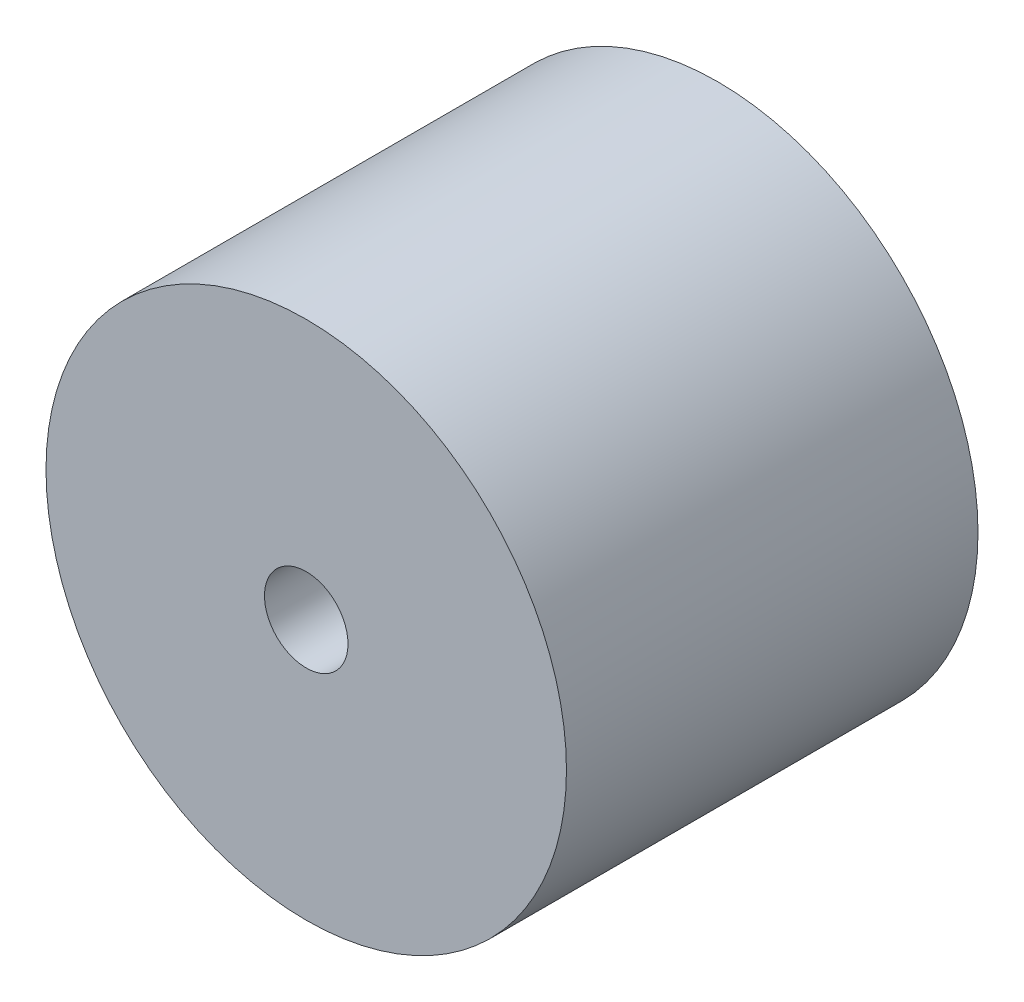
ISO-10303-21;
HEADER;
FILE_DESCRIPTION(('STEP AP214'),'2;1');
FILE_NAME('part.step','',(''),(''),'','','');
FILE_SCHEMA(('AUTOMOTIVE_DESIGN { 1 0 10303 214 1 1 1 1 }'));
ENDSEC;
DATA;
#1=APPLICATION_CONTEXT('core data for automotive mechanical design processes');
#2=APPLICATION_PROTOCOL_DEFINITION('international standard','automotive_design',2000,#1);
#3=PRODUCT_CONTEXT('',#1,'mechanical');
#4=PRODUCT('Part','Part','',(#3));
#5=PRODUCT_RELATED_PRODUCT_CATEGORY('part','',(#4));
#6=PRODUCT_DEFINITION_FORMATION('','',#4);
#7=PRODUCT_DEFINITION_CONTEXT('part definition',#1,'design');
#8=PRODUCT_DEFINITION('design','',#6,#7);
#9=PRODUCT_DEFINITION_SHAPE('','',#8);
#10=(LENGTH_UNIT() NAMED_UNIT(*) SI_UNIT(.MILLI.,.METRE.));
#11=(NAMED_UNIT(*) PLANE_ANGLE_UNIT() SI_UNIT($,.RADIAN.));
#12=(NAMED_UNIT(*) SI_UNIT($,.STERADIAN.) SOLID_ANGLE_UNIT());
#13=UNCERTAINTY_MEASURE_WITH_UNIT(LENGTH_MEASURE(1.E-05),#10,'distance_accuracy_value','');
#14=(GEOMETRIC_REPRESENTATION_CONTEXT(3) GLOBAL_UNCERTAINTY_ASSIGNED_CONTEXT((#13)) GLOBAL_UNIT_ASSIGNED_CONTEXT((#10,
#11,#12)) REPRESENTATION_CONTEXT('',''));
#15=CARTESIAN_POINT('',(0.,0.,0.));
#16=DIRECTION('',(0.,0.,1.));
#17=DIRECTION('',(1.,0.,0.));
#18=AXIS2_PLACEMENT_3D('',#15,#16,#17);
#19=CARTESIAN_POINT('',(0.,0.,68.));
#20=DIRECTION('',(0.,0.,1.));
#21=DIRECTION('',(1.,0.,0.));
#22=AXIS2_PLACEMENT_3D('',#19,#20,#21);
#23=PLANE('',#22);
#24=CARTESIAN_POINT('',(0.,0.,68.));
#25=DIRECTION('',(0.,0.,1.));
#26=DIRECTION('',(1.,0.,0.));
#27=AXIS2_PLACEMENT_3D('',#24,#25,#26);
#28=CIRCLE('',#27,43.);
#29=CARTESIAN_POINT('',(43.,0.,68.));
#30=VERTEX_POINT('',#29);
#31=EDGE_CURVE('E10',#30,#30,#28,.T.);
#32=ORIENTED_EDGE('',*,*,#31,.T.);
#33=EDGE_LOOP('',(#32));
#34=FACE_BOUND('',#33,.T.);
#35=CARTESIAN_POINT('',(0.,0.,68.));
#36=DIRECTION('',(0.,0.,1.));
#37=DIRECTION('',(1.,0.,0.));
#38=AXIS2_PLACEMENT_3D('',#35,#36,#37);
#39=CIRCLE('',#38,6.9);
#40=CARTESIAN_POINT('',(6.9,0.,68.));
#41=VERTEX_POINT('',#40);
#42=EDGE_CURVE('E40',#41,#41,#39,.T.);
#43=ORIENTED_EDGE('',*,*,#42,.F.);
#44=EDGE_LOOP('',(#43));
#45=FACE_BOUND('',#44,.T.);
#46=ADVANCED_FACE('F29',(#34,#45),#23,.T.);
#47=CARTESIAN_POINT('',(0.,0.,0.));
#48=DIRECTION('',(0.,0.,1.));
#49=DIRECTION('',(1.,0.,0.));
#50=AXIS2_PLACEMENT_3D('',#47,#48,#49);
#51=PLANE('',#50);
#52=CARTESIAN_POINT('',(0.,0.,0.));
#53=DIRECTION('',(0.,0.,1.));
#54=DIRECTION('',(1.,0.,0.));
#55=AXIS2_PLACEMENT_3D('',#52,#53,#54);
#56=CIRCLE('',#55,43.);
#57=CARTESIAN_POINT('',(43.,0.,0.));
#58=VERTEX_POINT('',#57);
#59=EDGE_CURVE('E33',#58,#58,#56,.T.);
#60=ORIENTED_EDGE('',*,*,#59,.F.);
#61=EDGE_LOOP('',(#60));
#62=FACE_BOUND('',#61,.T.);
#63=CARTESIAN_POINT('',(0.,0.,0.));
#64=DIRECTION('',(0.,0.,1.));
#65=DIRECTION('',(1.,0.,0.));
#66=AXIS2_PLACEMENT_3D('',#63,#64,#65);
#67=CIRCLE('',#66,6.9);
#68=CARTESIAN_POINT('',(6.9,0.,0.));
#69=VERTEX_POINT('',#68);
#70=EDGE_CURVE('E42',#69,#69,#67,.T.);
#71=ORIENTED_EDGE('',*,*,#70,.T.);
#72=EDGE_LOOP('',(#71));
#73=FACE_BOUND('',#72,.T.);
#74=ADVANCED_FACE('F52',(#62,#73),#51,.F.);
#75=CARTESIAN_POINT('',(0.,0.,68.));
#76=DIRECTION('',(0.,0.,-1.));
#77=DIRECTION('',(-1.,0.,0.));
#78=AXIS2_PLACEMENT_3D('',#75,#76,#77);
#79=CYLINDRICAL_SURFACE('',#78,43.);
#80=ORIENTED_EDGE('',*,*,#31,.F.);
#81=EDGE_LOOP('',(#80));
#82=FACE_BOUND('',#81,.T.);
#83=ORIENTED_EDGE('',*,*,#59,.T.);
#84=EDGE_LOOP('',(#83));
#85=FACE_BOUND('',#84,.T.);
#86=ADVANCED_FACE('F31',(#82,#85),#79,.T.);
#87=CARTESIAN_POINT('',(0.,0.,68.));
#88=DIRECTION('',(0.,0.,-1.));
#89=DIRECTION('',(-1.,0.,0.));
#90=AXIS2_PLACEMENT_3D('',#87,#88,#89);
#91=CYLINDRICAL_SURFACE('',#90,6.9);
#92=ORIENTED_EDGE('',*,*,#42,.T.);
#93=EDGE_LOOP('',(#92));
#94=FACE_BOUND('',#93,.T.);
#95=ORIENTED_EDGE('',*,*,#70,.F.);
#96=EDGE_LOOP('',(#95));
#97=FACE_BOUND('',#96,.T.);
#98=ADVANCED_FACE('F48',(#94,#97),#91,.F.);
#99=CLOSED_SHELL('',(#46,#74,#86,#98));
#100=MANIFOLD_SOLID_BREP('B2',#99);
#101=ADVANCED_BREP_SHAPE_REPRESENTATION('',(#18,#100),#14);
#102=SHAPE_DEFINITION_REPRESENTATION(#9,#101);
ENDSEC;
END-ISO-10303-21;
